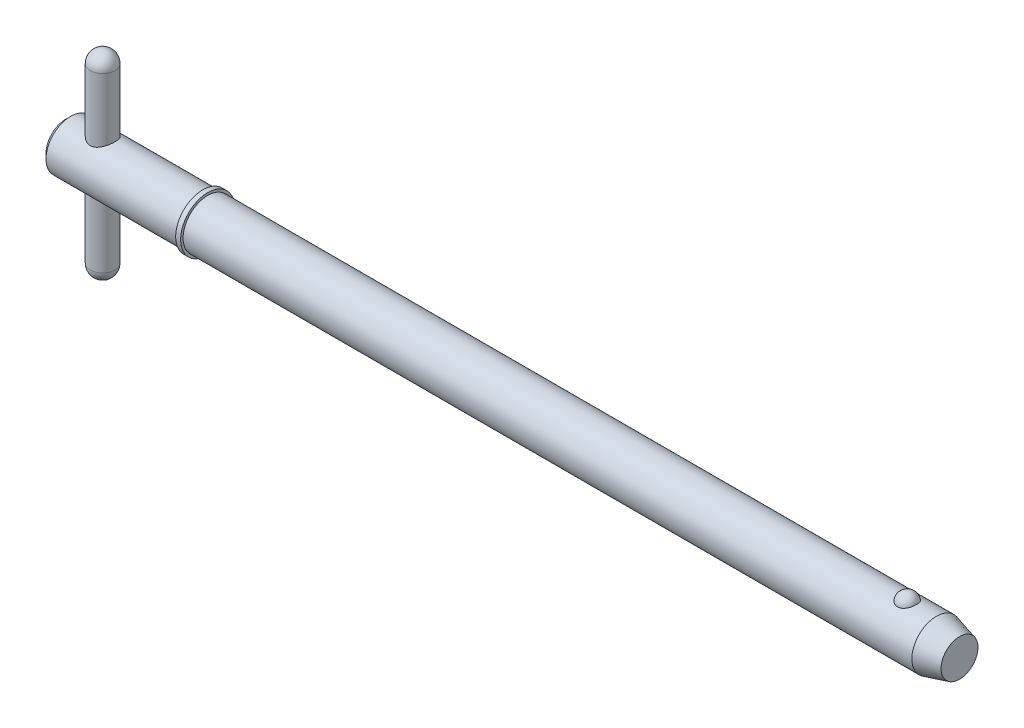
ISO-10303-21;
HEADER;
FILE_DESCRIPTION(('STEP AP214'),'2;1');
FILE_NAME('part.step','',(''),(''),'','','');
FILE_SCHEMA(('AUTOMOTIVE_DESIGN { 1 0 10303 214 1 1 1 1 }'));
ENDSEC;
DATA;
#1=APPLICATION_CONTEXT('core data for automotive mechanical design processes');
#2=APPLICATION_PROTOCOL_DEFINITION('international standard','automotive_design',2000,#1);
#3=PRODUCT_CONTEXT('',#1,'mechanical');
#4=PRODUCT('Part','Part','',(#3));
#5=PRODUCT_RELATED_PRODUCT_CATEGORY('part','',(#4));
#6=PRODUCT_DEFINITION_FORMATION('','',#4);
#7=PRODUCT_DEFINITION_CONTEXT('part definition',#1,'design');
#8=PRODUCT_DEFINITION('design','',#6,#7);
#9=PRODUCT_DEFINITION_SHAPE('','',#8);
#10=(LENGTH_UNIT() NAMED_UNIT(*) SI_UNIT(.MILLI.,.METRE.));
#11=(NAMED_UNIT(*) PLANE_ANGLE_UNIT() SI_UNIT($,.RADIAN.));
#12=(NAMED_UNIT(*) SI_UNIT($,.STERADIAN.) SOLID_ANGLE_UNIT());
#13=UNCERTAINTY_MEASURE_WITH_UNIT(LENGTH_MEASURE(1.E-05),#10,'distance_accuracy_value','');
#14=(GEOMETRIC_REPRESENTATION_CONTEXT(3) GLOBAL_UNCERTAINTY_ASSIGNED_CONTEXT((#13)) GLOBAL_UNIT_ASSIGNED_CONTEXT((#10,
#11,#12)) REPRESENTATION_CONTEXT('',''));
#15=CARTESIAN_POINT('',(0.,0.,0.));
#16=DIRECTION('',(0.,0.,1.));
#17=DIRECTION('',(1.,0.,0.));
#18=AXIS2_PLACEMENT_3D('',#15,#16,#17);
#19=CARTESIAN_POINT('',(4.755,12.7,0.));
#20=DIRECTION('',(0.,-1.,0.));
#21=DIRECTION('',(0.,0.,-1.));
#22=AXIS2_PLACEMENT_3D('',#19,#20,#21);
#23=CYLINDRICAL_SURFACE('',#22,1.585);
#24=CARTESIAN_POINT('',(4.755,-11.115,0.));
#25=DIRECTION('',(0.,-1.,0.));
#26=DIRECTION('',(0.,0.,-1.));
#27=AXIS2_PLACEMENT_3D('',#24,#25,#26);
#28=CIRCLE('',#27,1.585);
#29=CARTESIAN_POINT('',(4.755,-11.115,-1.585));
#30=VERTEX_POINT('',#29);
#31=EDGE_CURVE('P0_E10',#30,#30,#28,.F.);
#32=ORIENTED_EDGE('',*,*,#31,.T.);
#33=EDGE_LOOP('',(#32));
#34=FACE_BOUND('',#33,.T.);
#35=CARTESIAN_POINT('',(4.755,11.115,0.));
#36=DIRECTION('',(0.,-1.,0.));
#37=DIRECTION('',(0.,0.,-1.));
#38=AXIS2_PLACEMENT_3D('',#35,#36,#37);
#39=CIRCLE('',#38,1.585);
#40=CARTESIAN_POINT('',(4.755,11.115,-1.585));
#41=VERTEX_POINT('',#40);
#42=EDGE_CURVE('P0_E21',#41,#41,#39,.T.);
#43=ORIENTED_EDGE('',*,*,#42,.T.);
#44=EDGE_LOOP('',(#43));
#45=FACE_BOUND('',#44,.T.);
#46=ADVANCED_FACE('P0_F14',(#34,#45),#23,.T.);
#47=CARTESIAN_POINT('',(4.755,-11.115,0.));
#48=DIRECTION('',(0.,0.,1.));
#49=DIRECTION('',(1.,0.,0.));
#50=AXIS2_PLACEMENT_3D('',#47,#48,#49);
#51=SPHERICAL_SURFACE('',#50,1.585);
#52=CARTESIAN_POINT('',(4.755,-11.115,0.));
#53=DIRECTION('',(0.,-1.,0.));
#54=DIRECTION('',(0.,0.,-1.));
#55=AXIS2_PLACEMENT_3D('',#52,#53,#54);
#56=SPHERICAL_SURFACE('',#55,1.585);
#57=ORIENTED_EDGE('',*,*,#31,.F.);
#58=EDGE_LOOP('',(#57));
#59=FACE_BOUND('',#58,.T.);
#60=ADVANCED_FACE('P0_F29',(#59),#56,.T.);
#61=CARTESIAN_POINT('',(4.755,11.115,0.));
#62=DIRECTION('',(0.,0.,1.));
#63=DIRECTION('',(1.,0.,0.));
#64=AXIS2_PLACEMENT_3D('',#61,#62,#63);
#65=SPHERICAL_SURFACE('',#64,1.585);
#66=CARTESIAN_POINT('',(4.755,11.115,0.));
#67=DIRECTION('',(0.,-1.,0.));
#68=DIRECTION('',(0.,0.,-1.));
#69=AXIS2_PLACEMENT_3D('',#66,#67,#68);
#70=SPHERICAL_SURFACE('',#69,1.585);
#71=ORIENTED_EDGE('',*,*,#42,.F.);
#72=EDGE_LOOP('',(#71));
#73=FACE_BOUND('',#72,.T.);
#74=ADVANCED_FACE('P0_F16',(#73),#70,.T.);
#75=CLOSED_SHELL('',(#46,#60,#74));
#76=MANIFOLD_SOLID_BREP('P0_B1',#75);
#77=CARTESIAN_POINT('',(0.,0.,0.));
#78=DIRECTION('',(1.,0.,0.));
#79=DIRECTION('',(0.,0.,-1.));
#80=AXIS2_PLACEMENT_3D('',#77,#78,#79);
#81=CYLINDRICAL_SURFACE('',#80,3.175);
#82=CARTESIAN_POINT('',(112.147684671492,0.,0.));
#83=DIRECTION('',(1.,0.,0.));
#84=DIRECTION('',(0.,0.,-1.));
#85=AXIS2_PLACEMENT_3D('',#82,#83,#84);
#86=CIRCLE('',#85,3.175);
#87=CARTESIAN_POINT('',(112.147684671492,0.,-3.175));
#88=VERTEX_POINT('',#87);
#89=EDGE_CURVE('P1_E81',#88,#88,#86,.T.);
#90=ORIENTED_EDGE('',*,*,#89,.F.);
#91=EDGE_LOOP('',(#90));
#92=FACE_BOUND('',#91,.T.);
#93=CARTESIAN_POINT('',(18.29,0.,0.));
#94=DIRECTION('',(1.,0.,0.));
#95=DIRECTION('',(0.,0.,-1.));
#96=AXIS2_PLACEMENT_3D('',#93,#94,#95);
#97=CIRCLE('',#96,3.175);
#98=CARTESIAN_POINT('',(18.29,0.,-3.175));
#99=VERTEX_POINT('',#98);
#100=EDGE_CURVE('P1_E85',#99,#99,#97,.T.);
#101=ORIENTED_EDGE('',*,*,#100,.T.);
#102=EDGE_LOOP('',(#101));
#103=FACE_BOUND('',#102,.T.);
#104=CARTESIAN_POINT('',(108.37572762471,2.92898950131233,1.2254164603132));
#105=CARTESIAN_POINT('',(108.312316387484,2.92899434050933,1.22541146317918));
#106=CARTESIAN_POINT('',(108.248797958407,2.93112688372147,1.2203464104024));
#107=CARTESIAN_POINT('',(108.123530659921,2.93942752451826,1.20020949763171));
#108=CARTESIAN_POINT('',(108.061786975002,2.9456063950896,1.1851109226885));
#109=CARTESIAN_POINT('',(107.942065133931,2.96127115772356,1.14540352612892));
#110=CARTESIAN_POINT('',(107.884077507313,2.97074831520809,1.12081980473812));
#111=CARTESIAN_POINT('',(107.773194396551,2.99197584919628,1.06285154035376));
#112=CARTESIAN_POINT('',(107.720296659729,3.0037252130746,1.02947091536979));
#113=CARTESIAN_POINT('',(107.619268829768,3.02865714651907,0.953674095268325));
#114=CARTESIAN_POINT('',(107.571324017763,3.04187163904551,0.911021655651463));
#115=CARTESIAN_POINT('',(107.483036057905,3.06808741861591,0.818400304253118));
#116=CARTESIAN_POINT('',(107.442695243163,3.08108863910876,0.768429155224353));
#117=CARTESIAN_POINT('',(107.368803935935,3.10614903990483,0.660064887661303));
#118=CARTESIAN_POINT('',(107.335633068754,3.11814104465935,0.601396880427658));
#119=CARTESIAN_POINT('',(107.279119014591,3.13926931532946,0.479026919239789));
#120=CARTESIAN_POINT('',(107.255776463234,3.14840539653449,0.415324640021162));
#121=CARTESIAN_POINT('',(107.219178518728,3.16298160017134,0.283885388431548));
#122=CARTESIAN_POINT('',(107.206040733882,3.16837855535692,0.216110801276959));
#123=CARTESIAN_POINT('',(107.190567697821,3.17475386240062,0.0791367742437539));
#124=CARTESIAN_POINT('',(107.188232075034,3.17573236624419,0.00993738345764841));
#125=CARTESIAN_POINT('',(107.194388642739,3.17318075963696,-0.127420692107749));
#126=CARTESIAN_POINT('',(107.202807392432,3.16968122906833,-0.195583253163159));
#127=CARTESIAN_POINT('',(107.230175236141,3.1585790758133,-0.329413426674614));
#128=CARTESIAN_POINT('',(107.249124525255,3.15097637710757,-0.395080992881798));
#129=CARTESIAN_POINT('',(107.297205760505,3.13242485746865,-0.522180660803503));
#130=CARTESIAN_POINT('',(107.326352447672,3.12147119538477,-0.583606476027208));
#131=CARTESIAN_POINT('',(107.394235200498,3.09734973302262,-0.700436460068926));
#132=CARTESIAN_POINT('',(107.432972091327,3.08418174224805,-0.755840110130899));
#133=CARTESIAN_POINT('',(107.519477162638,3.05694884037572,-0.859404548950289));
#134=CARTESIAN_POINT('',(107.567296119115,3.04287919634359,-0.907521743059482));
#135=CARTESIAN_POINT('',(107.670735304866,3.01548927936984,-0.994758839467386));
#136=CARTESIAN_POINT('',(107.726354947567,3.0021689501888,-1.03387941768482));
#137=CARTESIAN_POINT('',(107.842809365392,2.97810316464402,-1.10126594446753));
#138=CARTESIAN_POINT('',(107.903518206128,2.96731170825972,-1.12973256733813));
#139=CARTESIAN_POINT('',(108.029371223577,2.94928934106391,-1.17598467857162));
#140=CARTESIAN_POINT('',(108.094513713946,2.94205708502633,-1.19377420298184));
#141=CARTESIAN_POINT('',(108.223856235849,2.93233065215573,-1.21746387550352));
#142=CARTESIAN_POINT('',(108.287938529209,2.92961621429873,-1.22391763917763));
#143=CARTESIAN_POINT('',(108.416337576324,2.92855752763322,-1.22644976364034));
#144=CARTESIAN_POINT('',(108.480654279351,2.93021238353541,-1.22253024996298));
#145=CARTESIAN_POINT('',(108.605523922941,2.9375685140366,-1.20474140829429));
#146=CARTESIAN_POINT('',(108.666131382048,2.94313790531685,-1.19119621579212));
#147=CARTESIAN_POINT('',(108.784110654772,2.95756226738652,-1.15491492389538));
#148=CARTESIAN_POINT('',(108.841482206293,2.96641750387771,-1.13217808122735));
#149=CARTESIAN_POINT('',(108.952769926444,2.98669918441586,-1.07755083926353));
#150=CARTESIAN_POINT('',(109.006584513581,2.9981771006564,-1.0454730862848));
#151=CARTESIAN_POINT('',(109.108147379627,3.02240235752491,-0.973220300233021));
#152=CARTESIAN_POINT('',(109.155894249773,3.03514999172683,-0.933043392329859));
#153=CARTESIAN_POINT('',(109.246581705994,3.06131230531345,-0.843372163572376));
#154=CARTESIAN_POINT('',(109.289158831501,3.07472822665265,-0.793510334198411));
#155=CARTESIAN_POINT('',(109.365676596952,3.10021106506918,-0.687241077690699));
#156=CARTESIAN_POINT('',(109.399615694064,3.1122777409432,-0.630832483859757));
#157=CARTESIAN_POINT('',(109.459120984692,3.134208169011,-0.511059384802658));
#158=CARTESIAN_POINT('',(109.484389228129,3.14399040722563,-0.447531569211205));
#159=CARTESIAN_POINT('',(109.524511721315,3.15983820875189,-0.316827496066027));
#160=CARTESIAN_POINT('',(109.539365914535,3.16590375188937,-0.249651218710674));
#161=CARTESIAN_POINT('',(109.558358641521,3.17370076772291,-0.113549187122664));
#162=CARTESIAN_POINT('',(109.562496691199,3.17543204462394,-0.0446233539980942));
#163=CARTESIAN_POINT('',(109.559969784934,3.17438372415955,0.0929938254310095));
#164=CARTESIAN_POINT('',(109.553305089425,3.17160423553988,0.16168517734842));
#165=CARTESIAN_POINT('',(109.529375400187,3.1618438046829,0.296502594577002));
#166=CARTESIAN_POINT('',(109.512167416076,3.15488546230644,0.362640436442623));
#167=CARTESIAN_POINT('',(109.467547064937,3.13748892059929,0.490896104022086));
#168=CARTESIAN_POINT('',(109.440133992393,3.12705048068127,0.553013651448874));
#169=CARTESIAN_POINT('',(109.375462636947,3.10369139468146,0.671876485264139));
#170=CARTESIAN_POINT('',(109.338146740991,3.0907563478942,0.72858760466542));
#171=CARTESIAN_POINT('',(109.254524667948,3.06381731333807,0.834653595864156));
#172=CARTESIAN_POINT('',(109.208218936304,3.04981337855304,0.884008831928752));
#173=CARTESIAN_POINT('',(109.107718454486,3.02230423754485,0.973916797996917));
#174=CARTESIAN_POINT('',(109.053535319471,3.00879833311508,1.01448227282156));
#175=CARTESIAN_POINT('',(108.938529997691,2.98383625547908,1.0857155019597));
#176=CARTESIAN_POINT('',(108.877705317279,2.9723808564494,1.11637952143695));
#177=CARTESIAN_POINT('',(108.753369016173,2.95329063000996,1.16592590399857));
#178=CARTESIAN_POINT('',(108.690023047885,2.9455373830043,1.18517901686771));
#179=CARTESIAN_POINT('',(108.56076644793,2.9342556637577,1.21284802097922));
#180=CARTESIAN_POINT('',(108.494864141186,2.93071450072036,1.2212964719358));
#181=CARTESIAN_POINT('',(108.411116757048,2.9291525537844,1.22502505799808));
#182=CARTESIAN_POINT('',(108.393426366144,2.92898815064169,1.22541785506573));
#183=CARTESIAN_POINT('',(108.37572762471,2.92898950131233,1.2254164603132));
#184=B_SPLINE_CURVE_WITH_KNOTS('',3,(#104,#105,#106,#107,#108,#109,#110,#111,#112,#113,#114,
#115,#116,#117,#118,#119,#120,#121,#122,#123,#124,#125,#126,#127,#128,#129,#130,#131,#132,#133,
#134,#135,#136,#137,#138,#139,#140,#141,#142,#143,#144,#145,#146,#147,#148,#149,#150,#151,#152,
#153,#154,#155,#156,#157,#158,#159,#160,#161,#162,#163,#164,#165,#166,#167,#168,#169,#170,#171,
#172,#173,#174,#175,#176,#177,#178,#179,#180,#181,#182,#183),.UNSPECIFIED.,.T.,.F.,(4,2,2,2,2,2,
2,2,2,2,2,2,2,2,2,2,2,2,2,2,2,2,2,2,2,2,2,2,2,2,2,2,2,2,2,2,2,2,2,4),(0.,0.190186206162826,
0.380880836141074,0.571074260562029,0.761183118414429,0.956866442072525,1.15260970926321,
1.3570177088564,1.56143892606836,1.76818248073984,1.97491892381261,2.18025109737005,
2.38558707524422,2.59122111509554,2.79687285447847,3.00371012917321,3.2105318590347,
3.41323429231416,3.61586005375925,3.80828192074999,4.00066436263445,4.18685798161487,
4.37306665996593,4.56330302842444,4.75358348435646,4.95345287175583,5.15335793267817,
5.35957003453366,5.56578325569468,5.7720057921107,5.97822335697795,6.18333558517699,
6.38846199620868,6.59480900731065,6.80114579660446,7.00718137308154,7.21329457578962,
7.41228022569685,7.61066481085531,7.66374777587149),.UNSPECIFIED.);
#185=CARTESIAN_POINT('',(108.37572762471,2.92898950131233,1.2254164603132));
#186=VERTEX_POINT('',#185);
#187=EDGE_CURVE('P1_E35',#186,#186,#184,.T.);
#188=ORIENTED_EDGE('',*,*,#187,.T.);
#189=EDGE_LOOP('',(#188));
#190=FACE_BOUND('',#189,.T.);
#191=ADVANCED_FACE('P1_F13',(#92,#103,#190),#81,.T.);
#192=CARTESIAN_POINT('',(0.,0.,0.));
#193=DIRECTION('',(-1.,0.,0.));
#194=DIRECTION('',(0.,0.,1.));
#195=AXIS2_PLACEMENT_3D('',#192,#193,#194);
#196=PLANE('',#195);
#197=CARTESIAN_POINT('',(0.,0.,0.));
#198=DIRECTION('',(1.,0.,0.));
#199=DIRECTION('',(0.,0.,-1.));
#200=AXIS2_PLACEMENT_3D('',#197,#198,#199);
#201=CIRCLE('',#200,2.54);
#202=CARTESIAN_POINT('',(0.,0.,-2.54));
#203=VERTEX_POINT('',#202);
#204=EDGE_CURVE('P1_E9',#203,#203,#201,.T.);
#205=ORIENTED_EDGE('',*,*,#204,.F.);
#206=EDGE_LOOP('',(#205));
#207=FACE_BOUND('',#206,.T.);
#208=ADVANCED_FACE('P1_F15',(#207),#196,.T.);
#209=CARTESIAN_POINT('',(0.634999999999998,0.,0.));
#210=DIRECTION('',(1.,0.,0.));
#211=DIRECTION('',(0.,0.,-1.));
#212=AXIS2_PLACEMENT_3D('',#209,#210,#211);
#213=CONICAL_SURFACE('',#212,3.175,0.78539816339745);
#214=ORIENTED_EDGE('',*,*,#204,.T.);
#215=EDGE_LOOP('',(#214));
#216=FACE_BOUND('',#215,.T.);
#217=CARTESIAN_POINT('',(0.634999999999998,0.,0.));
#218=DIRECTION('',(1.,0.,0.));
#219=DIRECTION('',(0.,0.,-1.));
#220=AXIS2_PLACEMENT_3D('',#217,#218,#219);
#221=CIRCLE('',#220,3.175);
#222=CARTESIAN_POINT('',(0.634999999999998,0.,-3.175));
#223=VERTEX_POINT('',#222);
#224=EDGE_CURVE('P1_E26',#223,#223,#221,.T.);
#225=ORIENTED_EDGE('',*,*,#224,.F.);
#226=EDGE_LOOP('',(#225));
#227=FACE_BOUND('',#226,.T.);
#228=ADVANCED_FACE('P1_F77',(#216,#227),#213,.T.);
#229=CARTESIAN_POINT('',(0.,0.,0.));
#230=DIRECTION('',(1.,0.,0.));
#231=DIRECTION('',(0.,0.,-1.));
#232=AXIS2_PLACEMENT_3D('',#229,#230,#231);
#233=CYLINDRICAL_SURFACE('',#232,3.175);
#234=CARTESIAN_POINT('',(4.755,-2.75107251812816,1.585));
#235=CARTESIAN_POINT('',(4.67238891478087,-2.7510796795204,1.58499425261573));
#236=CARTESIAN_POINT('',(4.58967306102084,-2.75485010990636,1.57849830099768));
#237=CARTESIAN_POINT('',(4.42677850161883,-2.76938647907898,1.55284486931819));
#238=CARTESIAN_POINT('',(4.34660551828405,-2.78016716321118,1.53366069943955));
#239=CARTESIAN_POINT('',(4.19146029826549,-2.80716278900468,1.48366329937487));
#240=CARTESIAN_POINT('',(4.11646293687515,-2.8233488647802,1.45291173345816));
#241=CARTESIAN_POINT('',(3.97271079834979,-2.85928672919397,1.38084067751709));
#242=CARTESIAN_POINT('',(3.90395634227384,-2.87903870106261,1.33952064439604));
#243=CARTESIAN_POINT('',(3.76839976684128,-2.921867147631,1.24350234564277));
#244=CARTESIAN_POINT('',(3.702222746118,-2.94508343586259,1.18798355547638));
#245=CARTESIAN_POINT('',(3.5796334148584,-2.99109588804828,1.06685014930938));
#246=CARTESIAN_POINT('',(3.52322596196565,-3.01389183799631,1.00123054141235));
#247=CARTESIAN_POINT('',(3.41807024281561,-3.05832598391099,0.856373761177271));
#248=CARTESIAN_POINT('',(3.37009053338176,-3.07978367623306,0.776518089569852));
#249=CARTESIAN_POINT('',(3.28853137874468,-3.11730894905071,0.608596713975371));
#250=CARTESIAN_POINT('',(3.25494287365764,-3.1333799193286,0.520536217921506));
#251=CARTESIAN_POINT('',(3.20559401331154,-3.15731341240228,0.345327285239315));
#252=CARTESIAN_POINT('',(3.18873760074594,-3.16567752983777,0.258557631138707));
#253=CARTESIAN_POINT('',(3.16972238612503,-3.17512718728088,0.0830496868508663));
#254=CARTESIAN_POINT('',(3.16755472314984,-3.17621711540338,-0.00568738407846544));
#255=CARTESIAN_POINT('',(3.1775542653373,-3.17123385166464,-0.174372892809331));
#256=CARTESIAN_POINT('',(3.18849502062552,-3.16577346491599,-0.254416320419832));
#257=CARTESIAN_POINT('',(3.22220680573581,-3.14922844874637,-0.411354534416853));
#258=CARTESIAN_POINT('',(3.2449787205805,-3.13814339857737,-0.488249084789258));
#259=CARTESIAN_POINT('',(3.30185558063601,-3.111172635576,-0.638050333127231));
#260=CARTESIAN_POINT('',(3.33611332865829,-3.09522247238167,-0.710886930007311));
#261=CARTESIAN_POINT('',(3.41477890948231,-3.05996035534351,-0.849953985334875));
#262=CARTESIAN_POINT('',(3.45919037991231,-3.04064719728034,-0.916182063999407));
#263=CARTESIAN_POINT('',(3.5617148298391,-2.99832415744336,-1.04681642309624));
#264=CARTESIAN_POINT('',(3.62072497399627,-2.97513741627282,-1.11046186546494));
#265=CARTESIAN_POINT('',(3.7483697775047,-2.92885066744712,-1.22736291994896));
#266=CARTESIAN_POINT('',(3.81701173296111,-2.90575073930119,-1.2806105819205));
#267=CARTESIAN_POINT('',(3.96727993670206,-2.86067370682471,-1.37849835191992));
#268=CARTESIAN_POINT('',(4.04945242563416,-2.83885964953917,-1.42238246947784));
#269=CARTESIAN_POINT('',(4.2213558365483,-2.80110454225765,-1.49537418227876));
#270=CARTESIAN_POINT('',(4.3110787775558,-2.78515738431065,-1.52449715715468));
#271=CARTESIAN_POINT('',(4.48806324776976,-2.76271292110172,-1.56478065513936));
#272=CARTESIAN_POINT('',(4.57495732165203,-2.75556745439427,-1.57718067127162));
#273=CARTESIAN_POINT('',(4.74985771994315,-2.74969306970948,-1.58740564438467));
#274=CARTESIAN_POINT('',(4.8378632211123,-2.75095824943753,-1.58524082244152));
#275=CARTESIAN_POINT('',(5.00227282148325,-2.76107477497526,-1.56753530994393));
#276=CARTESIAN_POINT('',(5.07889680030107,-2.76908515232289,-1.55347662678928));
#277=CARTESIAN_POINT('',(5.22855309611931,-2.79054849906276,-1.51458035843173));
#278=CARTESIAN_POINT('',(5.30158424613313,-2.80400322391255,-1.489739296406));
#279=CARTESIAN_POINT('',(5.44583114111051,-2.83556995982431,-1.42877335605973));
#280=CARTESIAN_POINT('',(5.51680600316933,-2.85386886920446,-1.39217900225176));
#281=CARTESIAN_POINT('',(5.6520174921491,-2.89289503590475,-1.30915485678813));
#282=CARTESIAN_POINT('',(5.71625063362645,-2.91362353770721,-1.26272001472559));
#283=CARTESIAN_POINT('',(5.8445938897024,-2.95830220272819,-1.15451693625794));
#284=CARTESIAN_POINT('',(5.90767560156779,-2.98233004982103,-1.09155543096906));
#285=CARTESIAN_POINT('',(6.0226995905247,-3.02864458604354,-0.955560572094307));
#286=CARTESIAN_POINT('',(6.07463814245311,-3.05093069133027,-0.882523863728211));
#287=CARTESIAN_POINT('',(6.16704288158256,-3.09200671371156,-0.725836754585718));
#288=CARTESIAN_POINT('',(6.20717458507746,-3.11069030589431,-0.64195924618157));
#289=CARTESIAN_POINT('',(6.27235859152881,-3.1416474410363,-0.467442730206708));
#290=CARTESIAN_POINT('',(6.29742409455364,-3.15392659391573,-0.376809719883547));
#291=CARTESIAN_POINT('',(6.32960989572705,-3.16979844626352,-0.200314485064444));
#292=CARTESIAN_POINT('',(6.33816324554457,-3.17408359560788,-0.114775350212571));
#293=CARTESIAN_POINT('',(6.34130309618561,-3.17565001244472,0.0566108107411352));
#294=CARTESIAN_POINT('',(6.33589445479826,-3.17293371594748,0.142457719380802));
#295=CARTESIAN_POINT('',(6.31221457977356,-3.16120608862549,0.306097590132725));
#296=CARTESIAN_POINT('',(6.2948097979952,-3.15261910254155,0.38404960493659));
#297=CARTESIAN_POINT('',(6.24879775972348,-3.13040364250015,0.535801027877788));
#298=CARTESIAN_POINT('',(6.22018889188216,-3.11677444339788,0.609599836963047));
#299=CARTESIAN_POINT('',(6.15130303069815,-3.08497808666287,0.754502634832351));
#300=CARTESIAN_POINT('',(6.11057850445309,-3.0666414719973,0.82535556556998));
#301=CARTESIAN_POINT('',(6.01917980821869,-3.02735012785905,0.95951596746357));
#302=CARTESIAN_POINT('',(5.96850106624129,-3.00639419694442,1.02281994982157));
#303=CARTESIAN_POINT('',(5.8528006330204,-2.96149402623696,1.1467073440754));
#304=CARTESIAN_POINT('',(5.78685463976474,-2.93745961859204,1.20639723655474));
#305=CARTESIAN_POINT('',(5.64552278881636,-2.89084502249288,1.31419099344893));
#306=CARTESIAN_POINT('',(5.57012871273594,-2.8682661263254,1.36228466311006));
#307=CARTESIAN_POINT('',(5.40892145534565,-2.82661780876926,1.44677201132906));
#308=CARTESIAN_POINT('',(5.32285703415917,-2.80767948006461,1.48275497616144));
#309=CARTESIAN_POINT('',(5.14469010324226,-2.77716572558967,1.53916557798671));
#310=CARTESIAN_POINT('',(5.05260892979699,-2.76556569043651,1.55964525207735));
#311=CARTESIAN_POINT('',(4.92544162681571,-2.75613775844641,1.57618070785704));
#312=CARTESIAN_POINT('',(4.89147210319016,-2.75424493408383,1.57948285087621));
#313=CARTESIAN_POINT('',(4.82334103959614,-2.75171079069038,1.58389375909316));
#314=CARTESIAN_POINT('',(4.78917948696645,-2.75106955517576,1.58500237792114));
#315=CARTESIAN_POINT('',(4.755,-2.75107251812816,1.585));
#316=B_SPLINE_CURVE_WITH_KNOTS('',3,(#234,#235,#236,#237,#238,#239,#240,#241,#242,#243,#244,
#245,#246,#247,#248,#249,#250,#251,#252,#253,#254,#255,#256,#257,#258,#259,#260,#261,#262,#263,
#264,#265,#266,#267,#268,#269,#270,#271,#272,#273,#274,#275,#276,#277,#278,#279,#280,#281,#282,
#283,#284,#285,#286,#287,#288,#289,#290,#291,#292,#293,#294,#295,#296,#297,#298,#299,#300,#301,
#302,#303,#304,#305,#306,#307,#308,#309,#310,#311,#312,#313,#314,#315),.UNSPECIFIED.,.T.,.F.,(4,
2,2,2,2,2,2,2,2,2,2,2,2,2,2,2,2,2,2,2,2,2,2,2,2,2,2,2,2,2,2,2,2,2,2,2,2,2,2,2,4),(0.,
0.247689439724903,0.495901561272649,0.742808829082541,0.989728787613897,1.25694656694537,
1.52429683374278,1.80959781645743,2.0947189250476,2.35960564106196,2.62433255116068,
2.86610932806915,3.1079041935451,3.35305262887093,3.59828902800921,3.86665310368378,
4.13522157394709,4.4207514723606,4.70598326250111,4.9686344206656,5.23110127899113,
5.46499114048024,5.69895647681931,5.94376186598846,6.1886932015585,6.46438263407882,
6.74016408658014,7.0231370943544,7.30586181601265,7.5626977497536,7.81944433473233,
8.05935987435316,8.29930993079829,8.54954401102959,8.79989329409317,9.07508848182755,
9.35052473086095,9.63453318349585,9.91758407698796,10.0200561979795,10.1225351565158),.UNSPECIFIED.);
#317=CARTESIAN_POINT('',(4.755,-2.75107251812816,1.585));
#318=VERTEX_POINT('',#317);
#319=EDGE_CURVE('P1_E17',#318,#318,#316,.T.);
#320=ORIENTED_EDGE('',*,*,#319,.F.);
#321=EDGE_LOOP('',(#320));
#322=FACE_BOUND('',#321,.T.);
#323=CARTESIAN_POINT('',(4.755,2.75107251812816,1.585));
#324=CARTESIAN_POINT('',(4.83761108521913,2.7510796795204,1.58499425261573));
#325=CARTESIAN_POINT('',(4.92032693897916,2.75485010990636,1.57849830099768));
#326=CARTESIAN_POINT('',(5.08322149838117,2.76938647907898,1.55284486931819));
#327=CARTESIAN_POINT('',(5.16339448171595,2.78016716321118,1.53366069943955));
#328=CARTESIAN_POINT('',(5.31853970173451,2.80716278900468,1.48366329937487));
#329=CARTESIAN_POINT('',(5.39353706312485,2.8233488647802,1.45291173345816));
#330=CARTESIAN_POINT('',(5.53728920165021,2.85928672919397,1.38084067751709));
#331=CARTESIAN_POINT('',(5.60604365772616,2.87903870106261,1.33952064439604));
#332=CARTESIAN_POINT('',(5.74160023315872,2.921867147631,1.24350234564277));
#333=CARTESIAN_POINT('',(5.807777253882,2.94508343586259,1.18798355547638));
#334=CARTESIAN_POINT('',(5.9303665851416,2.99109588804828,1.06685014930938));
#335=CARTESIAN_POINT('',(5.98677403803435,3.01389183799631,1.00123054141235));
#336=CARTESIAN_POINT('',(6.09192975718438,3.05832598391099,0.85637376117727));
#337=CARTESIAN_POINT('',(6.13990946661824,3.07978367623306,0.776518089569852));
#338=CARTESIAN_POINT('',(6.22146862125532,3.11730894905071,0.608596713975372));
#339=CARTESIAN_POINT('',(6.25505712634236,3.1333799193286,0.520536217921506));
#340=CARTESIAN_POINT('',(6.30440598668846,3.15731341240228,0.345327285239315));
#341=CARTESIAN_POINT('',(6.32126239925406,3.16567752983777,0.258557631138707));
#342=CARTESIAN_POINT('',(6.34027761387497,3.17512718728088,0.0830496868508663));
#343=CARTESIAN_POINT('',(6.34244527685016,3.17621711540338,-0.00568738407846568));
#344=CARTESIAN_POINT('',(6.3324457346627,3.17123385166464,-0.174372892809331));
#345=CARTESIAN_POINT('',(6.32150497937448,3.16577346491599,-0.254416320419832));
#346=CARTESIAN_POINT('',(6.28779319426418,3.14922844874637,-0.411354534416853));
#347=CARTESIAN_POINT('',(6.2650212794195,3.13814339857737,-0.488249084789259));
#348=CARTESIAN_POINT('',(6.20814441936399,3.111172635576,-0.638050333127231));
#349=CARTESIAN_POINT('',(6.17388667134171,3.09522247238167,-0.710886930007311));
#350=CARTESIAN_POINT('',(6.09522109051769,3.05996035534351,-0.849953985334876));
#351=CARTESIAN_POINT('',(6.05080962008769,3.04064719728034,-0.916182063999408));
#352=CARTESIAN_POINT('',(5.9482851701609,2.99832415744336,-1.04681642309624));
#353=CARTESIAN_POINT('',(5.88927502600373,2.97513741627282,-1.11046186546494));
#354=CARTESIAN_POINT('',(5.7616302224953,2.92885066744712,-1.22736291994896));
#355=CARTESIAN_POINT('',(5.69298826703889,2.90575073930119,-1.2806105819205));
#356=CARTESIAN_POINT('',(5.54272006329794,2.86067370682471,-1.37849835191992));
#357=CARTESIAN_POINT('',(5.46054757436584,2.83885964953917,-1.42238246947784));
#358=CARTESIAN_POINT('',(5.2886441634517,2.80110454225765,-1.49537418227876));
#359=CARTESIAN_POINT('',(5.19892122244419,2.78515738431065,-1.52449715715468));
#360=CARTESIAN_POINT('',(5.02193675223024,2.76271292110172,-1.56478065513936));
#361=CARTESIAN_POINT('',(4.93504267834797,2.75556745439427,-1.57718067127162));
#362=CARTESIAN_POINT('',(4.76014228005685,2.74969306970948,-1.58740564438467));
#363=CARTESIAN_POINT('',(4.6721367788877,2.75095824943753,-1.58524082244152));
#364=CARTESIAN_POINT('',(4.50772717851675,2.76107477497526,-1.56753530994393));
#365=CARTESIAN_POINT('',(4.43110319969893,2.76908515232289,-1.55347662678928));
#366=CARTESIAN_POINT('',(4.28144690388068,2.79054849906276,-1.51458035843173));
#367=CARTESIAN_POINT('',(4.20841575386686,2.80400322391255,-1.489739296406));
#368=CARTESIAN_POINT('',(4.06416885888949,2.83556995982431,-1.42877335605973));
#369=CARTESIAN_POINT('',(3.99319399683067,2.85386886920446,-1.39217900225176));
#370=CARTESIAN_POINT('',(3.8579825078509,2.89289503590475,-1.30915485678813));
#371=CARTESIAN_POINT('',(3.79374936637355,2.91362353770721,-1.26272001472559));
#372=CARTESIAN_POINT('',(3.6654061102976,2.95830220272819,-1.15451693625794));
#373=CARTESIAN_POINT('',(3.60232439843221,2.98233004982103,-1.09155543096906));
#374=CARTESIAN_POINT('',(3.4873004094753,3.02864458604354,-0.955560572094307));
#375=CARTESIAN_POINT('',(3.43536185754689,3.05093069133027,-0.88252386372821));
#376=CARTESIAN_POINT('',(3.34295711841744,3.09200671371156,-0.725836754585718));
#377=CARTESIAN_POINT('',(3.30282541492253,3.11069030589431,-0.64195924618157));
#378=CARTESIAN_POINT('',(3.23764140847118,3.14164744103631,-0.467442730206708));
#379=CARTESIAN_POINT('',(3.21257590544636,3.15392659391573,-0.376809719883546));
#380=CARTESIAN_POINT('',(3.18039010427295,3.16979844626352,-0.200314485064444));
#381=CARTESIAN_POINT('',(3.17183675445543,3.17408359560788,-0.114775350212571));
#382=CARTESIAN_POINT('',(3.16869690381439,3.17565001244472,0.0566108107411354));
#383=CARTESIAN_POINT('',(3.17410554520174,3.17293371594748,0.142457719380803));
#384=CARTESIAN_POINT('',(3.19778542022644,3.16120608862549,0.306097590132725));
#385=CARTESIAN_POINT('',(3.2151902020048,3.15261910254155,0.384049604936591));
#386=CARTESIAN_POINT('',(3.26120224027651,3.13040364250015,0.535801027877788));
#387=CARTESIAN_POINT('',(3.28981110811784,3.11677444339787,0.609599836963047));
#388=CARTESIAN_POINT('',(3.35869696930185,3.08497808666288,0.754502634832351));
#389=CARTESIAN_POINT('',(3.39942149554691,3.0666414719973,0.82535556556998));
#390=CARTESIAN_POINT('',(3.49082019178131,3.02735012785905,0.95951596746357));
#391=CARTESIAN_POINT('',(3.54149893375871,3.00639419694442,1.02281994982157));
#392=CARTESIAN_POINT('',(3.6571993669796,2.96149402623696,1.1467073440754));
#393=CARTESIAN_POINT('',(3.72314536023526,2.93745961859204,1.20639723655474));
#394=CARTESIAN_POINT('',(3.86447721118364,2.89084502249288,1.31419099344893));
#395=CARTESIAN_POINT('',(3.93987128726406,2.8682661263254,1.36228466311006));
#396=CARTESIAN_POINT('',(4.10107854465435,2.82661780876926,1.44677201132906));
#397=CARTESIAN_POINT('',(4.18714296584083,2.80767948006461,1.48275497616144));
#398=CARTESIAN_POINT('',(4.36530989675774,2.77716572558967,1.53916557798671));
#399=CARTESIAN_POINT('',(4.45739107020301,2.76556569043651,1.55964525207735));
#400=CARTESIAN_POINT('',(4.58455837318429,2.75613775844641,1.57618070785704));
#401=CARTESIAN_POINT('',(4.61852789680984,2.75424493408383,1.57948285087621));
#402=CARTESIAN_POINT('',(4.68665896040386,2.75171079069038,1.58389375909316));
#403=CARTESIAN_POINT('',(4.72082051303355,2.75106955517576,1.58500237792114));
#404=CARTESIAN_POINT('',(4.755,2.75107251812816,1.585));
#405=B_SPLINE_CURVE_WITH_KNOTS('',3,(#323,#324,#325,#326,#327,#328,#329,#330,#331,#332,#333,
#334,#335,#336,#337,#338,#339,#340,#341,#342,#343,#344,#345,#346,#347,#348,#349,#350,#351,#352,
#353,#354,#355,#356,#357,#358,#359,#360,#361,#362,#363,#364,#365,#366,#367,#368,#369,#370,#371,
#372,#373,#374,#375,#376,#377,#378,#379,#380,#381,#382,#383,#384,#385,#386,#387,#388,#389,#390,
#391,#392,#393,#394,#395,#396,#397,#398,#399,#400,#401,#402,#403,#404),.UNSPECIFIED.,.T.,.F.,(4,
2,2,2,2,2,2,2,2,2,2,2,2,2,2,2,2,2,2,2,2,2,2,2,2,2,2,2,2,2,2,2,2,2,2,2,2,2,2,2,4),(0.,
0.247689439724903,0.495901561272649,0.742808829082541,0.989728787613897,1.25694656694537,
1.52429683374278,1.80959781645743,2.0947189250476,2.35960564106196,2.62433255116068,
2.86610932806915,3.1079041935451,3.35305262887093,3.59828902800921,3.86665310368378,
4.13522157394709,4.4207514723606,4.70598326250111,4.9686344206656,5.23110127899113,
5.46499114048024,5.69895647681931,5.94376186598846,6.1886932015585,6.46438263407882,
6.74016408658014,7.0231370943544,7.30586181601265,7.5626977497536,7.81944433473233,
8.05935987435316,8.29930993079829,8.54954401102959,8.79989329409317,9.07508848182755,
9.35052473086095,9.63453318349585,9.91758407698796,10.0200561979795,10.1225351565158),.UNSPECIFIED.);
#406=CARTESIAN_POINT('',(4.755,2.75107251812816,1.585));
#407=VERTEX_POINT('',#406);
#408=EDGE_CURVE('P1_E43',#407,#407,#405,.T.);
#409=ORIENTED_EDGE('',*,*,#408,.F.);
#410=EDGE_LOOP('',(#409));
#411=FACE_BOUND('',#410,.T.);
#412=ORIENTED_EDGE('',*,*,#224,.T.);
#413=EDGE_LOOP('',(#412));
#414=FACE_BOUND('',#413,.T.);
#415=CARTESIAN_POINT('',(17.655,0.,0.));
#416=DIRECTION('',(1.,0.,0.));
#417=DIRECTION('',(0.,0.,-1.));
#418=AXIS2_PLACEMENT_3D('',#415,#416,#417);
#419=CIRCLE('',#418,3.175);
#420=CARTESIAN_POINT('',(17.655,0.,-3.175));
#421=VERTEX_POINT('',#420);
#422=EDGE_CURVE('P1_E31',#421,#421,#419,.T.);
#423=ORIENTED_EDGE('',*,*,#422,.F.);
#424=EDGE_LOOP('',(#423));
#425=FACE_BOUND('',#424,.T.);
#426=ADVANCED_FACE('P1_F103',(#322,#411,#414,#425),#233,.T.);
#427=CARTESIAN_POINT('',(17.655,3.175,0.));
#428=DIRECTION('',(-1.,0.,0.));
#429=DIRECTION('',(0.,0.,1.));
#430=AXIS2_PLACEMENT_3D('',#427,#428,#429);
#431=PLANE('',#430);
#432=ORIENTED_EDGE('',*,*,#422,.T.);
#433=EDGE_LOOP('',(#432));
#434=FACE_BOUND('',#433,.T.);
#435=CARTESIAN_POINT('',(17.655,0.,0.));
#436=DIRECTION('',(1.,0.,0.));
#437=DIRECTION('',(0.,0.,-1.));
#438=AXIS2_PLACEMENT_3D('',#435,#436,#437);
#439=CIRCLE('',#438,3.4925);
#440=CARTESIAN_POINT('',(17.655,0.,-3.4925));
#441=VERTEX_POINT('',#440);
#442=EDGE_CURVE('P1_E91',#441,#441,#439,.T.);
#443=ORIENTED_EDGE('',*,*,#442,.F.);
#444=EDGE_LOOP('',(#443));
#445=FACE_BOUND('',#444,.T.);
#446=ADVANCED_FACE('P1_F100',(#434,#445),#431,.T.);
#447=CARTESIAN_POINT('',(0.,0.,0.));
#448=DIRECTION('',(1.,0.,0.));
#449=DIRECTION('',(0.,0.,-1.));
#450=AXIS2_PLACEMENT_3D('',#447,#448,#449);
#451=CYLINDRICAL_SURFACE('',#450,3.4925);
#452=ORIENTED_EDGE('',*,*,#442,.T.);
#453=EDGE_LOOP('',(#452));
#454=FACE_BOUND('',#453,.T.);
#455=CARTESIAN_POINT('',(18.29,0.,0.));
#456=DIRECTION('',(1.,0.,0.));
#457=DIRECTION('',(0.,0.,-1.));
#458=AXIS2_PLACEMENT_3D('',#455,#456,#457);
#459=CIRCLE('',#458,3.4925);
#460=CARTESIAN_POINT('',(18.29,0.,-3.4925));
#461=VERTEX_POINT('',#460);
#462=EDGE_CURVE('P1_E88',#461,#461,#459,.T.);
#463=ORIENTED_EDGE('',*,*,#462,.F.);
#464=EDGE_LOOP('',(#463));
#465=FACE_BOUND('',#464,.T.);
#466=ADVANCED_FACE('P1_F68',(#454,#465),#451,.T.);
#467=CARTESIAN_POINT('',(18.29,3.4925,0.));
#468=DIRECTION('',(1.,0.,0.));
#469=DIRECTION('',(0.,0.,-1.));
#470=AXIS2_PLACEMENT_3D('',#467,#468,#469);
#471=PLANE('',#470);
#472=ORIENTED_EDGE('',*,*,#462,.T.);
#473=EDGE_LOOP('',(#472));
#474=FACE_BOUND('',#473,.T.);
#475=ORIENTED_EDGE('',*,*,#100,.F.);
#476=EDGE_LOOP('',(#475));
#477=FACE_BOUND('',#476,.T.);
#478=ADVANCED_FACE('P1_F62',(#474,#477),#471,.T.);
#479=CARTESIAN_POINT('',(115.11,0.,0.));
#480=DIRECTION('',(-1.,0.,0.));
#481=DIRECTION('',(0.,0.,1.));
#482=AXIS2_PLACEMENT_3D('',#479,#480,#481);
#483=CONICAL_SURFACE('',#482,2.38125000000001,0.261799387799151);
#484=ORIENTED_EDGE('',*,*,#89,.T.);
#485=EDGE_LOOP('',(#484));
#486=FACE_BOUND('',#485,.T.);
#487=CARTESIAN_POINT('',(115.11,0.,0.));
#488=DIRECTION('',(1.,0.,0.));
#489=DIRECTION('',(0.,0.,-1.));
#490=AXIS2_PLACEMENT_3D('',#487,#488,#489);
#491=CIRCLE('',#490,2.38125000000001);
#492=CARTESIAN_POINT('',(115.11,0.,-2.38125000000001));
#493=VERTEX_POINT('',#492);
#494=EDGE_CURVE('P1_E42',#493,#493,#491,.T.);
#495=ORIENTED_EDGE('',*,*,#494,.F.);
#496=EDGE_LOOP('',(#495));
#497=FACE_BOUND('',#496,.T.);
#498=ADVANCED_FACE('P1_F59',(#486,#497),#483,.T.);
#499=CARTESIAN_POINT('',(115.11,2.38125000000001,0.));
#500=DIRECTION('',(1.,0.,0.));
#501=DIRECTION('',(0.,0.,-1.));
#502=AXIS2_PLACEMENT_3D('',#499,#500,#501);
#503=PLANE('',#502);
#504=ORIENTED_EDGE('',*,*,#494,.T.);
#505=EDGE_LOOP('',(#504));
#506=FACE_BOUND('',#505,.T.);
#507=ADVANCED_FACE('P1_F55',(#506),#503,.T.);
#508=CARTESIAN_POINT('',(108.37572762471,2.8575,0.));
#509=DIRECTION('',(-1.,0.,0.));
#510=DIRECTION('',(0.,1.,0.));
#511=AXIS2_PLACEMENT_3D('',#508,#509,#510);
#512=SPHERICAL_SURFACE('',#511,1.22750000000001);
#513=ORIENTED_EDGE('',*,*,#187,.F.);
#514=EDGE_LOOP('',(#513));
#515=FACE_BOUND('',#514,.T.);
#516=ADVANCED_FACE('P1_F50',(#515),#512,.T.);
#517=CARTESIAN_POINT('',(4.755,-3.4925,0.));
#518=DIRECTION('',(0.,1.,0.));
#519=DIRECTION('',(0.,0.,1.));
#520=AXIS2_PLACEMENT_3D('',#517,#518,#519);
#521=CYLINDRICAL_SURFACE('',#520,1.585);
#522=ORIENTED_EDGE('',*,*,#319,.T.);
#523=EDGE_LOOP('',(#522));
#524=FACE_BOUND('',#523,.T.);
#525=ORIENTED_EDGE('',*,*,#408,.T.);
#526=EDGE_LOOP('',(#525));
#527=FACE_BOUND('',#526,.T.);
#528=ADVANCED_FACE('P1_F54',(#524,#527),#521,.F.);
#529=CLOSED_SHELL('',(#191,#208,#228,#426,#446,#466,#478,#498,#507,#516,#528));
#530=MANIFOLD_SOLID_BREP('P1_B1',#529);
#531=ADVANCED_BREP_SHAPE_REPRESENTATION('',(#18,#76,#530),#14);
#532=SHAPE_DEFINITION_REPRESENTATION(#9,#531);
ENDSEC;
END-ISO-10303-21;
